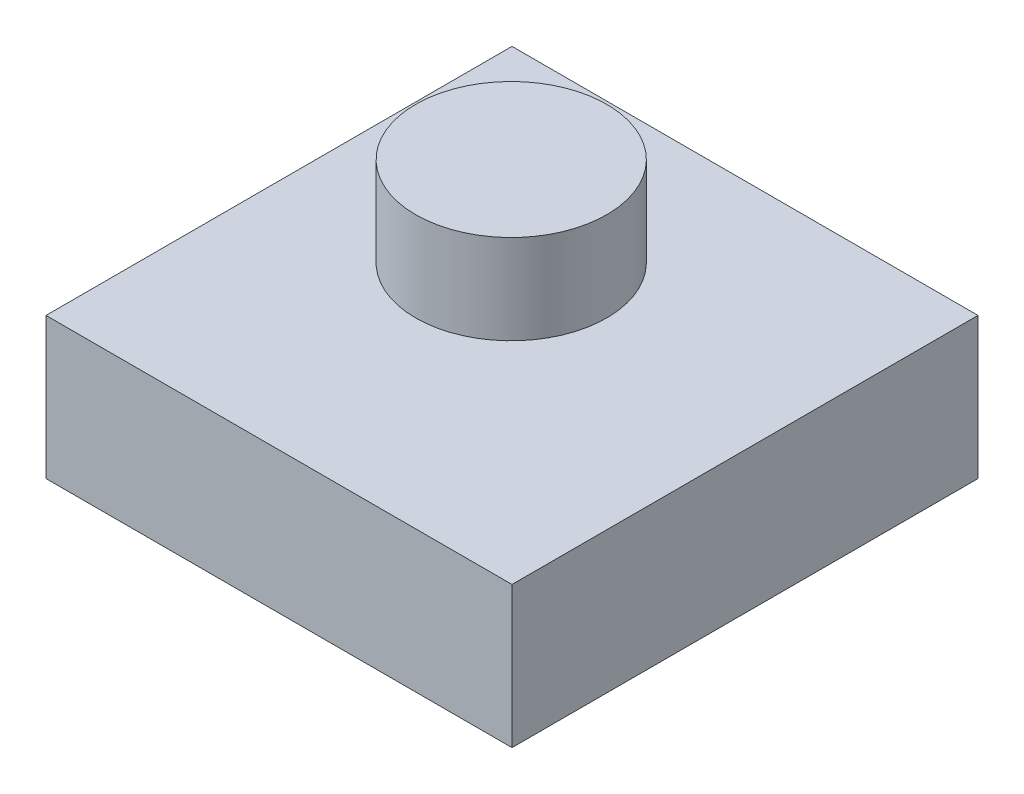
ISO-10303-21;
HEADER;
FILE_DESCRIPTION(('STEP AP214'),'2;1');
FILE_NAME('part.step','',(''),(''),'','','');
FILE_SCHEMA(('AUTOMOTIVE_DESIGN { 1 0 10303 214 1 1 1 1 }'));
ENDSEC;
DATA;
#1=APPLICATION_CONTEXT('core data for automotive mechanical design processes');
#2=APPLICATION_PROTOCOL_DEFINITION('international standard','automotive_design',2000,#1);
#3=PRODUCT_CONTEXT('',#1,'mechanical');
#4=PRODUCT('Part','Part','',(#3));
#5=PRODUCT_RELATED_PRODUCT_CATEGORY('part','',(#4));
#6=PRODUCT_DEFINITION_FORMATION('','',#4);
#7=PRODUCT_DEFINITION_CONTEXT('part definition',#1,'design');
#8=PRODUCT_DEFINITION('design','',#6,#7);
#9=PRODUCT_DEFINITION_SHAPE('','',#8);
#10=(LENGTH_UNIT() NAMED_UNIT(*) SI_UNIT(.MILLI.,.METRE.));
#11=(NAMED_UNIT(*) PLANE_ANGLE_UNIT() SI_UNIT($,.RADIAN.));
#12=(NAMED_UNIT(*) SI_UNIT($,.STERADIAN.) SOLID_ANGLE_UNIT());
#13=UNCERTAINTY_MEASURE_WITH_UNIT(LENGTH_MEASURE(1.E-05),#10,'distance_accuracy_value','');
#14=(GEOMETRIC_REPRESENTATION_CONTEXT(3) GLOBAL_UNCERTAINTY_ASSIGNED_CONTEXT((#13)) GLOBAL_UNIT_ASSIGNED_CONTEXT((#10,
#11,#12)) REPRESENTATION_CONTEXT('',''));
#15=CARTESIAN_POINT('',(0.,0.,0.));
#16=DIRECTION('',(0.,0.,1.));
#17=DIRECTION('',(1.,0.,0.));
#18=AXIS2_PLACEMENT_3D('',#15,#16,#17);
#19=CARTESIAN_POINT('',(-48.7636206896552,29.5774718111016,48.7636206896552));
#20=DIRECTION('',(0.,1.,0.));
#21=DIRECTION('',(0.,0.,1.));
#22=AXIS2_PLACEMENT_3D('',#19,#20,#21);
#23=PLANE('',#22);
#24=DIRECTION('',(0.,0.,1.));
#25=VECTOR('',#24,1.);
#26=CARTESIAN_POINT('',(-48.7636206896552,29.5774718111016,-48.7636206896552));
#27=LINE('',#26,#25);
#28=CARTESIAN_POINT('',(-48.7636206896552,29.5774718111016,-48.7636206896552));
#29=VERTEX_POINT('',#28);
#30=CARTESIAN_POINT('',(-48.7636206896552,29.5774718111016,48.7636206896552));
#31=VERTEX_POINT('',#30);
#32=EDGE_CURVE('E84',#29,#31,#27,.T.);
#33=ORIENTED_EDGE('',*,*,#32,.T.);
#34=DIRECTION('',(1.,0.,0.));
#35=VECTOR('',#34,1.);
#36=CARTESIAN_POINT('',(-48.7636206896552,29.5774718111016,48.7636206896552));
#37=LINE('',#36,#35);
#38=CARTESIAN_POINT('',(48.7636206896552,29.5774718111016,48.7636206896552));
#39=VERTEX_POINT('',#38);
#40=EDGE_CURVE('E79',#31,#39,#37,.T.);
#41=ORIENTED_EDGE('',*,*,#40,.T.);
#42=DIRECTION('',(0.,0.,-1.));
#43=VECTOR('',#42,1.);
#44=CARTESIAN_POINT('',(48.7636206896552,29.5774718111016,-48.7636206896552));
#45=LINE('',#44,#43);
#46=CARTESIAN_POINT('',(48.7636206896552,29.5774718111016,-48.7636206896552));
#47=VERTEX_POINT('',#46);
#48=EDGE_CURVE('E82',#39,#47,#45,.T.);
#49=ORIENTED_EDGE('',*,*,#48,.T.);
#50=DIRECTION('',(-1.,0.,0.));
#51=VECTOR('',#50,1.);
#52=CARTESIAN_POINT('',(-48.7636206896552,29.5774718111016,-48.7636206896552));
#53=LINE('',#52,#51);
#54=EDGE_CURVE('E49',#47,#29,#53,.T.);
#55=ORIENTED_EDGE('',*,*,#54,.T.);
#56=EDGE_LOOP('',(#33,#41,#49,#55));
#57=FACE_BOUND('',#56,.T.);
#58=CARTESIAN_POINT('',(-9.61693363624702,29.5774718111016,-9.45298710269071));
#59=DIRECTION('',(0.,1.,0.));
#60=DIRECTION('',(0.,0.,1.));
#61=AXIS2_PLACEMENT_3D('',#58,#59,#60);
#62=CIRCLE('',#61,20.);
#63=CARTESIAN_POINT('',(-9.61693363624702,29.5774718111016,10.5470128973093));
#64=VERTEX_POINT('',#63);
#65=EDGE_CURVE('E110',#64,#64,#62,.T.);
#66=ORIENTED_EDGE('',*,*,#65,.F.);
#67=EDGE_LOOP('',(#66));
#68=FACE_BOUND('',#67,.T.);
#69=ADVANCED_FACE('F32',(#57,#68),#23,.T.);
#70=CARTESIAN_POINT('',(-48.7636206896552,29.5774718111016,-48.7636206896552));
#71=DIRECTION('',(1.,0.,0.));
#72=DIRECTION('',(0.,0.,-1.));
#73=AXIS2_PLACEMENT_3D('',#70,#71,#72);
#74=PLANE('',#73);
#75=DIRECTION('',(0.,0.,1.));
#76=VECTOR('',#75,1.);
#77=CARTESIAN_POINT('',(-48.7636206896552,0.,-48.7636206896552));
#78=LINE('',#77,#76);
#79=CARTESIAN_POINT('',(-48.7636206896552,0.,-48.7636206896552));
#80=VERTEX_POINT('',#79);
#81=CARTESIAN_POINT('',(-48.7636206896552,0.,48.7636206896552));
#82=VERTEX_POINT('',#81);
#83=EDGE_CURVE('E96',#80,#82,#78,.T.);
#84=ORIENTED_EDGE('',*,*,#83,.T.);
#85=DIRECTION('',(0.,-1.,0.));
#86=VECTOR('',#85,1.);
#87=CARTESIAN_POINT('',(-48.7636206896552,29.5774718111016,48.7636206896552));
#88=LINE('',#87,#86);
#89=EDGE_CURVE('E11',#31,#82,#88,.T.);
#90=ORIENTED_EDGE('',*,*,#89,.F.);
#91=ORIENTED_EDGE('',*,*,#32,.F.);
#92=DIRECTION('',(0.,-1.,0.));
#93=VECTOR('',#92,1.);
#94=CARTESIAN_POINT('',(-48.7636206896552,29.5774718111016,-48.7636206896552));
#95=LINE('',#94,#93);
#96=EDGE_CURVE('E92',#29,#80,#95,.T.);
#97=ORIENTED_EDGE('',*,*,#96,.T.);
#98=EDGE_LOOP('',(#84,#90,#91,#97));
#99=FACE_BOUND('',#98,.T.);
#100=ADVANCED_FACE('F34',(#99),#74,.F.);
#101=CARTESIAN_POINT('',(-48.7636206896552,29.5774718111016,48.7636206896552));
#102=DIRECTION('',(0.,0.,-1.));
#103=DIRECTION('',(-1.,0.,0.));
#104=AXIS2_PLACEMENT_3D('',#101,#102,#103);
#105=PLANE('',#104);
#106=DIRECTION('',(1.,0.,0.));
#107=VECTOR('',#106,1.);
#108=CARTESIAN_POINT('',(-48.7636206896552,0.,48.7636206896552));
#109=LINE('',#108,#107);
#110=CARTESIAN_POINT('',(48.7636206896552,0.,48.7636206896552));
#111=VERTEX_POINT('',#110);
#112=EDGE_CURVE('E88',#82,#111,#109,.T.);
#113=ORIENTED_EDGE('',*,*,#112,.T.);
#114=DIRECTION('',(0.,-1.,0.));
#115=VECTOR('',#114,1.);
#116=CARTESIAN_POINT('',(48.7636206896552,29.5774718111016,48.7636206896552));
#117=LINE('',#116,#115);
#118=EDGE_CURVE('E41',#39,#111,#117,.T.);
#119=ORIENTED_EDGE('',*,*,#118,.F.);
#120=ORIENTED_EDGE('',*,*,#40,.F.);
#121=ORIENTED_EDGE('',*,*,#89,.T.);
#122=EDGE_LOOP('',(#113,#119,#120,#121));
#123=FACE_BOUND('',#122,.T.);
#124=ADVANCED_FACE('F87',(#123),#105,.F.);
#125=CARTESIAN_POINT('',(48.7636206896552,29.5774718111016,-48.7636206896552));
#126=DIRECTION('',(-1.,0.,0.));
#127=DIRECTION('',(0.,0.,1.));
#128=AXIS2_PLACEMENT_3D('',#125,#126,#127);
#129=PLANE('',#128);
#130=DIRECTION('',(0.,0.,-1.));
#131=VECTOR('',#130,1.);
#132=CARTESIAN_POINT('',(48.7636206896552,0.,-48.7636206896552));
#133=LINE('',#132,#131);
#134=CARTESIAN_POINT('',(48.7636206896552,0.,-48.7636206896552));
#135=VERTEX_POINT('',#134);
#136=EDGE_CURVE('E66',#111,#135,#133,.T.);
#137=ORIENTED_EDGE('',*,*,#136,.T.);
#138=DIRECTION('',(0.,-1.,0.));
#139=VECTOR('',#138,1.);
#140=CARTESIAN_POINT('',(48.7636206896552,29.5774718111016,-48.7636206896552));
#141=LINE('',#140,#139);
#142=EDGE_CURVE('E89',#47,#135,#141,.T.);
#143=ORIENTED_EDGE('',*,*,#142,.F.);
#144=ORIENTED_EDGE('',*,*,#48,.F.);
#145=ORIENTED_EDGE('',*,*,#118,.T.);
#146=EDGE_LOOP('',(#137,#143,#144,#145));
#147=FACE_BOUND('',#146,.T.);
#148=ADVANCED_FACE('F90',(#147),#129,.F.);
#149=CARTESIAN_POINT('',(-48.7636206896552,29.5774718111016,-48.7636206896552));
#150=DIRECTION('',(0.,0.,1.));
#151=DIRECTION('',(1.,0.,0.));
#152=AXIS2_PLACEMENT_3D('',#149,#150,#151);
#153=PLANE('',#152);
#154=DIRECTION('',(-1.,0.,0.));
#155=VECTOR('',#154,1.);
#156=CARTESIAN_POINT('',(-48.7636206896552,0.,-48.7636206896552));
#157=LINE('',#156,#155);
#158=EDGE_CURVE('E72',#135,#80,#157,.T.);
#159=ORIENTED_EDGE('',*,*,#158,.T.);
#160=ORIENTED_EDGE('',*,*,#96,.F.);
#161=ORIENTED_EDGE('',*,*,#54,.F.);
#162=ORIENTED_EDGE('',*,*,#142,.T.);
#163=EDGE_LOOP('',(#159,#160,#161,#162));
#164=FACE_BOUND('',#163,.T.);
#165=ADVANCED_FACE('F104',(#164),#153,.F.);
#166=CARTESIAN_POINT('',(-48.7636206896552,0.,48.7636206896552));
#167=DIRECTION('',(0.,1.,0.));
#168=DIRECTION('',(0.,0.,1.));
#169=AXIS2_PLACEMENT_3D('',#166,#167,#168);
#170=PLANE('',#169);
#171=ORIENTED_EDGE('',*,*,#83,.F.);
#172=ORIENTED_EDGE('',*,*,#158,.F.);
#173=ORIENTED_EDGE('',*,*,#136,.F.);
#174=ORIENTED_EDGE('',*,*,#112,.F.);
#175=EDGE_LOOP('',(#171,#172,#173,#174));
#176=FACE_BOUND('',#175,.T.);
#177=ADVANCED_FACE('F107',(#176),#170,.F.);
#178=CARTESIAN_POINT('',(-9.61693363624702,48.2974858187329,-9.45298710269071));
#179=DIRECTION('',(0.,-1.,0.));
#180=DIRECTION('',(0.,0.,-1.));
#181=AXIS2_PLACEMENT_3D('',#178,#179,#180);
#182=CYLINDRICAL_SURFACE('',#181,20.);
#183=CARTESIAN_POINT('',(-9.61693363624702,48.2974858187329,-9.45298710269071));
#184=DIRECTION('',(0.,1.,0.));
#185=DIRECTION('',(0.,0.,1.));
#186=AXIS2_PLACEMENT_3D('',#183,#184,#185);
#187=CIRCLE('',#186,20.);
#188=CARTESIAN_POINT('',(-9.61693363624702,48.2974858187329,10.5470128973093));
#189=VERTEX_POINT('',#188);
#190=EDGE_CURVE('E99',#189,#189,#187,.T.);
#191=ORIENTED_EDGE('',*,*,#190,.F.);
#192=EDGE_LOOP('',(#191));
#193=FACE_BOUND('',#192,.T.);
#194=ORIENTED_EDGE('',*,*,#65,.T.);
#195=EDGE_LOOP('',(#194));
#196=FACE_BOUND('',#195,.T.);
#197=ADVANCED_FACE('F118',(#193,#196),#182,.T.);
#198=CARTESIAN_POINT('',(-9.61693363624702,48.2974858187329,-9.45298710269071));
#199=DIRECTION('',(0.,1.,0.));
#200=DIRECTION('',(0.,0.,1.));
#201=AXIS2_PLACEMENT_3D('',#198,#199,#200);
#202=PLANE('',#201);
#203=ORIENTED_EDGE('',*,*,#190,.T.);
#204=EDGE_LOOP('',(#203));
#205=FACE_BOUND('',#204,.T.);
#206=ADVANCED_FACE('F116',(#205),#202,.T.);
#207=CLOSED_SHELL('',(#69,#100,#124,#148,#165,#177,#197,#206));
#208=MANIFOLD_SOLID_BREP('B2',#207);
#209=ADVANCED_BREP_SHAPE_REPRESENTATION('',(#18,#208),#14);
#210=SHAPE_DEFINITION_REPRESENTATION(#9,#209);
ENDSEC;
END-ISO-10303-21;
